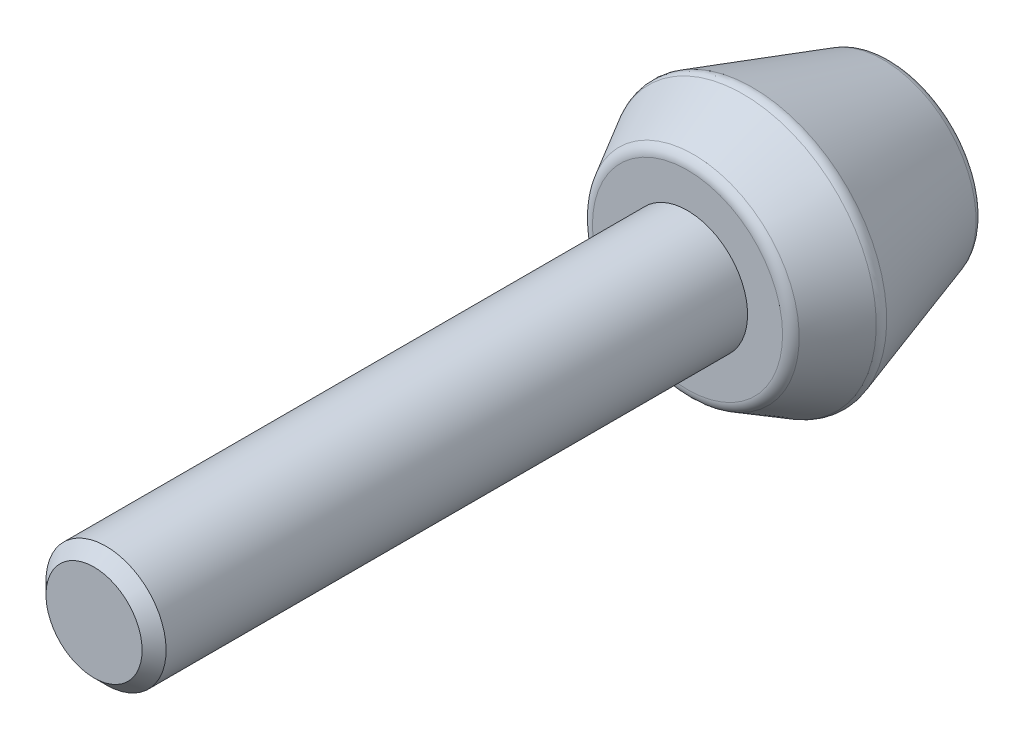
ISO-10303-21;
HEADER;
FILE_DESCRIPTION(('STEP AP214'),'2;1');
FILE_NAME('part.step','',(''),(''),'','','');
FILE_SCHEMA(('AUTOMOTIVE_DESIGN { 1 0 10303 214 1 1 1 1 }'));
ENDSEC;
DATA;
#1=APPLICATION_CONTEXT('core data for automotive mechanical design processes');
#2=APPLICATION_PROTOCOL_DEFINITION('international standard','automotive_design',2000,#1);
#3=PRODUCT_CONTEXT('',#1,'mechanical');
#4=PRODUCT('Part','Part','',(#3));
#5=PRODUCT_RELATED_PRODUCT_CATEGORY('part','',(#4));
#6=PRODUCT_DEFINITION_FORMATION('','',#4);
#7=PRODUCT_DEFINITION_CONTEXT('part definition',#1,'design');
#8=PRODUCT_DEFINITION('design','',#6,#7);
#9=PRODUCT_DEFINITION_SHAPE('','',#8);
#10=(LENGTH_UNIT() NAMED_UNIT(*) SI_UNIT(.MILLI.,.METRE.));
#11=(NAMED_UNIT(*) PLANE_ANGLE_UNIT() SI_UNIT($,.RADIAN.));
#12=(NAMED_UNIT(*) SI_UNIT($,.STERADIAN.) SOLID_ANGLE_UNIT());
#13=UNCERTAINTY_MEASURE_WITH_UNIT(LENGTH_MEASURE(1.E-05),#10,'distance_accuracy_value','');
#14=(GEOMETRIC_REPRESENTATION_CONTEXT(3) GLOBAL_UNCERTAINTY_ASSIGNED_CONTEXT((#13)) GLOBAL_UNIT_ASSIGNED_CONTEXT((#10,
#11,#12)) REPRESENTATION_CONTEXT('',''));
#15=CARTESIAN_POINT('',(0.,0.,0.));
#16=DIRECTION('',(0.,0.,1.));
#17=DIRECTION('',(1.,0.,0.));
#18=AXIS2_PLACEMENT_3D('',#15,#16,#17);
#19=CARTESIAN_POINT('',(0.,0.,2.));
#20=DIRECTION('',(0.,0.,1.));
#21=DIRECTION('',(-0.647135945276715,-0.762374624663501,0.));
#22=AXIS2_PLACEMENT_3D('',#19,#20,#21);
#23=CYLINDRICAL_SURFACE('',#22,2.5);
#24=CARTESIAN_POINT('',(0.,0.,32.7));
#25=DIRECTION('',(0.,0.,1.));
#26=DIRECTION('',(-0.647135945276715,-0.762374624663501,0.));
#27=AXIS2_PLACEMENT_3D('',#24,#25,#26);
#28=CIRCLE('',#27,2.5);
#29=CARTESIAN_POINT('',(-1.61783986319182,-1.90593656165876,32.7));
#30=VERTEX_POINT('',#29);
#31=EDGE_CURVE('E148',#30,#30,#28,.F.);
#32=ORIENTED_EDGE('',*,*,#31,.T.);
#33=EDGE_LOOP('',(#32));
#34=FACE_BOUND('',#33,.T.);
#35=CARTESIAN_POINT('',(0.,0.,8.5));
#36=DIRECTION('',(0.,0.,1.));
#37=DIRECTION('',(-0.55730654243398,-0.830306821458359,0.));
#38=AXIS2_PLACEMENT_3D('',#35,#36,#37);
#39=CIRCLE('',#38,2.5);
#40=CARTESIAN_POINT('',(-1.39326635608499,-2.07576705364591,8.5));
#41=VERTEX_POINT('',#40);
#42=EDGE_CURVE('E49',#41,#41,#39,.T.);
#43=ORIENTED_EDGE('',*,*,#42,.T.);
#44=EDGE_LOOP('',(#43));
#45=FACE_BOUND('',#44,.T.);
#46=ADVANCED_FACE('F14',(#34,#45),#23,.T.);
#47=CARTESIAN_POINT('',(0.,0.,32.7000000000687));
#48=DIRECTION('',(0.,0.,-1.));
#49=DIRECTION('',(0.647135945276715,0.762374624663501,0.));
#50=AXIS2_PLACEMENT_3D('',#47,#48,#49);
#51=CONICAL_SURFACE('',#50,2.49999999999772,0.785398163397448);
#52=ORIENTED_EDGE('',*,*,#31,.F.);
#53=EDGE_LOOP('',(#52));
#54=FACE_BOUND('',#53,.T.);
#55=CARTESIAN_POINT('',(0.,0.,33.2000000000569));
#56=DIRECTION('',(0.,0.,-1.));
#57=DIRECTION('',(0.647135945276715,0.762374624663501,0.));
#58=AXIS2_PLACEMENT_3D('',#55,#56,#57);
#59=CIRCLE('',#58,2.00000000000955);
#60=CARTESIAN_POINT('',(1.29427189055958,1.52474924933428,33.2000000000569));
#61=VERTEX_POINT('',#60);
#62=EDGE_CURVE('E18',#61,#61,#59,.T.);
#63=ORIENTED_EDGE('',*,*,#62,.T.);
#64=EDGE_LOOP('',(#63));
#65=FACE_BOUND('',#64,.T.);
#66=ADVANCED_FACE('F161',(#54,#65),#51,.T.);
#67=CARTESIAN_POINT('',(0.,0.,33.2));
#68=DIRECTION('',(0.,0.,-1.));
#69=DIRECTION('',(0.647135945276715,0.762374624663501,0.));
#70=AXIS2_PLACEMENT_3D('',#67,#68,#69);
#71=PLANE('',#70);
#72=ORIENTED_EDGE('',*,*,#62,.F.);
#73=EDGE_LOOP('',(#72));
#74=FACE_BOUND('',#73,.T.);
#75=ADVANCED_FACE('F16',(#74),#71,.F.);
#76=CARTESIAN_POINT('',(0.,0.,8.5));
#77=DIRECTION('',(0.,0.,-1.));
#78=DIRECTION('',(0.55730654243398,0.830306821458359,0.));
#79=AXIS2_PLACEMENT_3D('',#76,#77,#78);
#80=PLANE('',#79);
#81=ORIENTED_EDGE('',*,*,#42,.F.);
#82=EDGE_LOOP('',(#81));
#83=FACE_BOUND('',#82,.T.);
#84=CARTESIAN_POINT('',(0.,0.,8.5));
#85=DIRECTION('',(0.,0.,-1.));
#86=DIRECTION('',(0.557306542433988,0.830306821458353,0.));
#87=AXIS2_PLACEMENT_3D('',#84,#85,#86);
#88=CIRCLE('',#87,3.95693804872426);
#89=CARTESIAN_POINT('',(2.20522746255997,3.28547265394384,8.5));
#90=VERTEX_POINT('',#89);
#91=CARTESIAN_POINT('',(-2.20522746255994,-3.28547265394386,8.5));
#92=VERTEX_POINT('',#91);
#93=EDGE_CURVE('E41',#90,#92,#88,.T.);
#94=ORIENTED_EDGE('',*,*,#93,.F.);
#95=CARTESIAN_POINT('',(0.,0.,8.5));
#96=DIRECTION('',(0.,0.,-1.));
#97=DIRECTION('',(-0.55730654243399,-0.830306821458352,0.));
#98=AXIS2_PLACEMENT_3D('',#95,#96,#97);
#99=CIRCLE('',#98,3.95693804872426);
#100=EDGE_CURVE('E44',#92,#90,#99,.T.);
#101=ORIENTED_EDGE('',*,*,#100,.F.);
#102=EDGE_LOOP('',(#94,#101));
#103=FACE_BOUND('',#102,.T.);
#104=ADVANCED_FACE('F46',(#83,#103),#80,.F.);
#105=CARTESIAN_POINT('',(0.,0.,8.));
#106=DIRECTION('',(0.,0.,-1.));
#107=DIRECTION('',(0.557306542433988,0.830306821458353,0.));
#108=AXIS2_PLACEMENT_3D('',#105,#106,#107);
#109=TOROIDAL_SURFACE('',#108,3.95693804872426,0.5);
#110=CARTESIAN_POINT('',(0.,0.,8.24430168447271));
#111=DIRECTION('',(0.,0.,-1.));
#112=DIRECTION('',(0.55730654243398,0.830306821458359,0.));
#113=AXIS2_PLACEMENT_3D('',#110,#111,#112);
#114=CIRCLE('',#113,4.39319105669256);
#115=CARTESIAN_POINT('',(2.44835411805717,3.64769650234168,8.24430168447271));
#116=VERTEX_POINT('',#115);
#117=EDGE_CURVE('E54',#116,#116,#114,.T.);
#118=ORIENTED_EDGE('',*,*,#117,.F.);
#119=EDGE_LOOP('',(#118));
#120=FACE_BOUND('',#119,.T.);
#121=ORIENTED_EDGE('',*,*,#93,.T.);
#122=ORIENTED_EDGE('',*,*,#100,.T.);
#123=EDGE_LOOP('',(#121,#122));
#124=FACE_BOUND('',#123,.T.);
#125=ADVANCED_FACE('F53',(#120,#124),#109,.T.);
#126=CARTESIAN_POINT('',(0.,0.,6.18887432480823));
#127=DIRECTION('',(0.,0.,-1.));
#128=DIRECTION('',(0.55730654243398,0.830306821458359,0.));
#129=AXIS2_PLACEMENT_3D('',#126,#127,#128);
#130=CONICAL_SURFACE('',#129,5.54423037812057,0.510488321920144);
#131=CARTESIAN_POINT('',(0.,0.,6.18887432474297));
#132=DIRECTION('',(0.,0.,-1.));
#133=DIRECTION('',(0.55730654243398,0.830306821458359,0.));
#134=AXIS2_PLACEMENT_3D('',#131,#132,#133);
#135=CIRCLE('',#134,5.54423037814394);
#136=CARTESIAN_POINT('',(3.08983586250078,4.60341230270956,6.18887432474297));
#137=VERTEX_POINT('',#136);
#138=EDGE_CURVE('E92',#137,#137,#135,.T.);
#139=ORIENTED_EDGE('',*,*,#138,.F.);
#140=EDGE_LOOP('',(#139));
#141=FACE_BOUND('',#140,.T.);
#142=ORIENTED_EDGE('',*,*,#117,.T.);
#143=EDGE_LOOP('',(#142));
#144=FACE_BOUND('',#143,.T.);
#145=ADVANCED_FACE('F73',(#141,#144),#130,.T.);
#146=CARTESIAN_POINT('',(0.,0.,5.94457264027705));
#147=DIRECTION('',(0.,0.,-1.));
#148=DIRECTION('',(0.557306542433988,0.830306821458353,0.));
#149=AXIS2_PLACEMENT_3D('',#146,#147,#148);
#150=TOROIDAL_SURFACE('',#149,5.10797737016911,0.5);
#151=CARTESIAN_POINT('',(0.,0.,5.79362678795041));
#152=DIRECTION('',(0.,0.,1.));
#153=DIRECTION('',(-0.55730654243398,-0.830306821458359,0.));
#154=AXIS2_PLACEMENT_3D('',#151,#152,#153);
#155=CIRCLE('',#154,5.58464848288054);
#156=CARTESIAN_POINT('',(-3.11236113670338,-4.6369717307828,5.79362678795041));
#157=VERTEX_POINT('',#156);
#158=EDGE_CURVE('E9',#157,#157,#155,.F.);
#159=ORIENTED_EDGE('',*,*,#158,.F.);
#160=EDGE_LOOP('',(#159));
#161=FACE_BOUND('',#160,.T.);
#162=ORIENTED_EDGE('',*,*,#138,.T.);
#163=EDGE_LOOP('',(#162));
#164=FACE_BOUND('',#163,.T.);
#165=ADVANCED_FACE('F110',(#161,#164),#150,.T.);
#166=CARTESIAN_POINT('',(0.,0.,5.79362678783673));
#167=DIRECTION('',(0.,0.,1.));
#168=DIRECTION('',(-0.55730654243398,-0.830306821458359,0.));
#169=AXIS2_PLACEMENT_3D('',#166,#167,#168);
#170=CONICAL_SURFACE('',#169,5.58464848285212,0.306676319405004);
#171=ORIENTED_EDGE('',*,*,#158,.T.);
#172=EDGE_LOOP('',(#171));
#173=FACE_BOUND('',#172,.T.);
#174=CARTESIAN_POINT('',(0.,0.,0.3490541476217));
#175=DIRECTION('',(0.,0.,1.));
#176=DIRECTION('',(-0.55730654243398,-0.830306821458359,0.));
#177=AXIS2_PLACEMENT_3D('',#174,#175,#176);
#178=CIRCLE('',#177,3.86053381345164);
#179=CARTESIAN_POINT('',(-2.15150075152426,-3.20542755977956,0.3490541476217));
#180=VERTEX_POINT('',#179);
#181=EDGE_CURVE('E24',#180,#180,#178,.T.);
#182=ORIENTED_EDGE('',*,*,#181,.T.);
#183=EDGE_LOOP('',(#182));
#184=FACE_BOUND('',#183,.T.);
#185=ADVANCED_FACE('F108',(#173,#184),#170,.T.);
#186=CARTESIAN_POINT('',(0.,0.,0.5));
#187=DIRECTION('',(0.,0.,-1.));
#188=DIRECTION('',(0.557306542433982,0.830306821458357,0.));
#189=AXIS2_PLACEMENT_3D('',#186,#187,#188);
#190=TOROIDAL_SURFACE('',#189,3.38386270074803,0.5);
#191=CARTESIAN_POINT('',(0.,0.,0.));
#192=DIRECTION('',(0.,0.,1.));
#193=DIRECTION('',(0.557306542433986,0.830306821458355,0.));
#194=AXIS2_PLACEMENT_3D('',#191,#192,#193);
#195=CIRCLE('',#194,3.38386270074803);
#196=CARTESIAN_POINT('',(1.88584882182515,2.80964428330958,0.));
#197=VERTEX_POINT('',#196);
#198=CARTESIAN_POINT('',(-1.88584882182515,-2.80964428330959,0.));
#199=VERTEX_POINT('',#198);
#200=EDGE_CURVE('E32',#197,#199,#195,.T.);
#201=ORIENTED_EDGE('',*,*,#200,.T.);
#202=CARTESIAN_POINT('',(0.,0.,0.));
#203=DIRECTION('',(0.,0.,1.));
#204=DIRECTION('',(-0.557306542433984,-0.830306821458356,0.));
#205=AXIS2_PLACEMENT_3D('',#202,#203,#204);
#206=CIRCLE('',#205,3.38386270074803);
#207=EDGE_CURVE('E120',#199,#197,#206,.T.);
#208=ORIENTED_EDGE('',*,*,#207,.T.);
#209=EDGE_LOOP('',(#201,#208));
#210=FACE_BOUND('',#209,.T.);
#211=ORIENTED_EDGE('',*,*,#181,.F.);
#212=EDGE_LOOP('',(#211));
#213=FACE_BOUND('',#212,.T.);
#214=ADVANCED_FACE('F98',(#210,#213),#190,.T.);
#215=CARTESIAN_POINT('',(0.,0.,0.));
#216=DIRECTION('',(0.,0.,-1.));
#217=DIRECTION('',(0.55730654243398,0.830306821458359,0.));
#218=AXIS2_PLACEMENT_3D('',#215,#216,#217);
#219=PLANE('',#218);
#220=ORIENTED_EDGE('',*,*,#207,.F.);
#221=ORIENTED_EDGE('',*,*,#200,.F.);
#222=EDGE_LOOP('',(#220,#221));
#223=FACE_BOUND('',#222,.T.);
#224=ADVANCED_FACE('F75',(#223),#219,.T.);
#225=CLOSED_SHELL('',(#46,#66,#75,#104,#125,#145,#165,#185,#214,#224));
#226=MANIFOLD_SOLID_BREP('B1',#225);
#227=ADVANCED_BREP_SHAPE_REPRESENTATION('',(#18,#226),#14);
#228=SHAPE_DEFINITION_REPRESENTATION(#9,#227);
ENDSEC;
END-ISO-10303-21;
